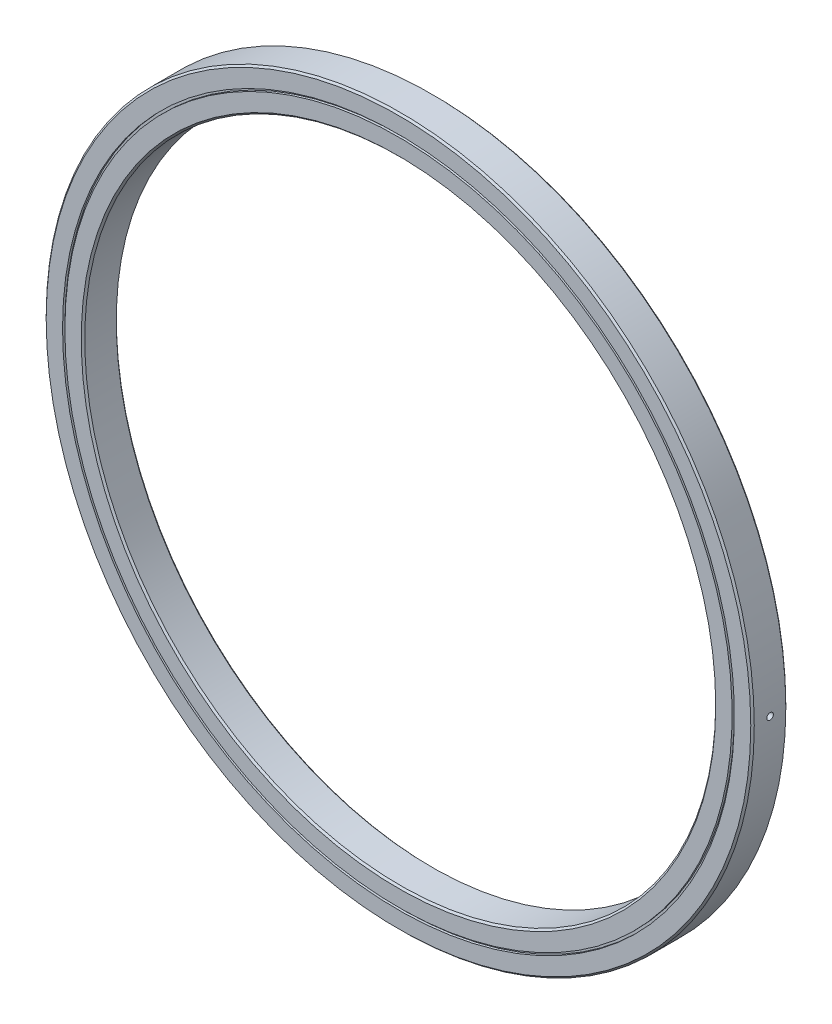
from build123d import *

# Parameters (mm, degrees)
BOSS_EXTRUDE4_DEPTH      = 2.5
BOSS_EXTRUDE4_DEPTH_BACK = 2.5
SKETCH3_R                = 50.5
SKETCH3_R_2              = 45
CHAMFER1_SIZE            = 0.25
SKETCH12_W               = 0.33
SKETCH12_H               = 0.33
CUT_EXTRUDE1_START       = 50.5
SKETCH13_R               = 0.46875
CUT_EXTRUDE1_DEPTH       = 1


with BuildPart() as part:
    # Sketch3 → Boss-Extrude4 (new, two sides: drawn at the far end of the back side and taken through both)
    with BuildSketch(Plane.XY.offset(-BOSS_EXTRUDE4_DEPTH_BACK)):
        Circle(SKETCH3_R)
        Circle(SKETCH3_R_2, mode=Mode.SUBTRACT)
    extrude(amount=BOSS_EXTRUDE4_DEPTH + BOSS_EXTRUDE4_DEPTH_BACK)

    # Chamfer1
    chamfer1_edges = [part.edges().sort_by_distance(p)[0] for p in [
        (-50.5, 0, -2.5),
        (-45, 0, -2.5),
        (-50.5, 0, 2.5),
        (-45, 0, 2.5),
    ]]
    chamfer(chamfer1_edges, length=CHAMFER1_SIZE)

    # Sketch12 → Cut-Revolve1 (revolve, cut)
    with BuildSketch(Plane(origin=(0, 0, 0), x_dir=(0, 0, -1), z_dir=(1, 0, 0)), mode=Mode.PRIVATE) as cut_revolve1_sk:
        with Locations((-2.335, 47.75)):
            Rectangle(SKETCH12_W, SKETCH12_H)
        with Locations((2.335, 47.75)):
            Rectangle(SKETCH12_W, SKETCH12_H)
    revolve(cut_revolve1_sk.sketch.rotate(Axis((0, 0, -2.5), (0, 0, 1)), 90), axis=Axis((0, 0, -2.5), (0, 0, 1)), mode=Mode.SUBTRACT)

    # Sketch13 → Cut-Extrude1 (cut)
    with BuildSketch(Plane(origin=(0, 0, 0), x_dir=(0, 0, -1), z_dir=(1, 0, 0)).offset(CUT_EXTRUDE1_START)):
        Circle(SKETCH13_R)
    cut_extrude1 = extrude(amount=-CUT_EXTRUDE1_DEPTH, mode=Mode.SUBTRACT)

    # Mirror1: Cut-Extrude1 across plane
    add(cut_extrude1.mirror(Plane(origin=(0, 0, 0), x_dir=(0, 0, 1), z_dir=(1, 0, 0))), mode=Mode.SUBTRACT)


solid = part.part
